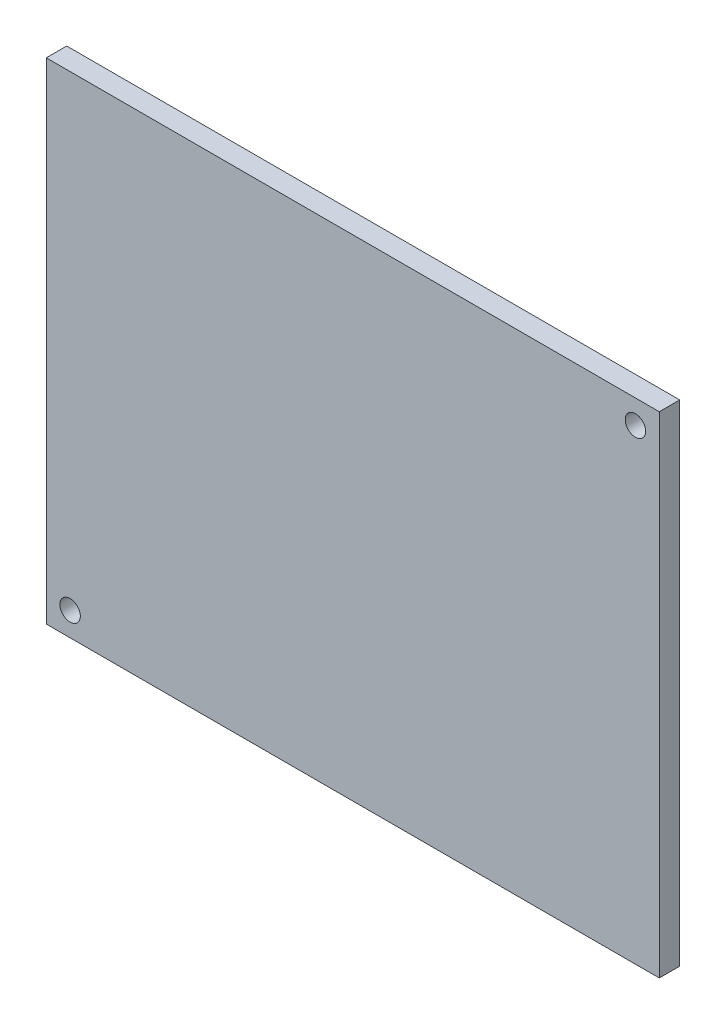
from build123d import *

# Parameters (mm, degrees)
CROQUIS1_W              = 90
CROQUIS1_H              = 72
SALIENTE_EXTRUIR2_DEPTH = 3
CROQUIS2_OUTSIDE_W      = 115.06
CROQUIS2_OUTSIDE_H      = 97.06
CROQUIS2_OUTSIDE_W_2    = 90
CROQUIS2_OUTSIDE_H_2    = 72
CROQUIS2_OUTSIDE_R      = 1.5
CORTAR_EXTRUIR1_DEPTH   = 58.706152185


with BuildPart() as part:
    # Croquis1 → Saliente-Extruir2 (new body)
    with BuildSketch(Plane.XY):
        Rectangle(CROQUIS1_W, CROQUIS1_H)
    extrude(amount=-SALIENTE_EXTRUIR2_DEPTH)

    # Croquis2 outside → Cortar-Extruir1 (cut, through all)
    # profile 1 of 3: a face of its own
    with BuildSketch(Plane.XY):
        Rectangle(CROQUIS2_OUTSIDE_W, CROQUIS2_OUTSIDE_H)
        Rectangle(CROQUIS2_OUTSIDE_W_2, CROQUIS2_OUTSIDE_H_2, mode=Mode.SUBTRACT)
    # profile 2 of 3: a face of its own
    with BuildSketch(Plane.XY):
        with Locations((-41.5, -32.5)):
            Circle(CROQUIS2_OUTSIDE_R)
    # profile 3 of 3: a face of its own
    with BuildSketch(Plane.XY):
        with Locations((41.5, 32.5)):
            Circle(CROQUIS2_OUTSIDE_R)
    extrude(amount=-CORTAR_EXTRUIR1_DEPTH, mode=Mode.SUBTRACT)


solid = part.part
